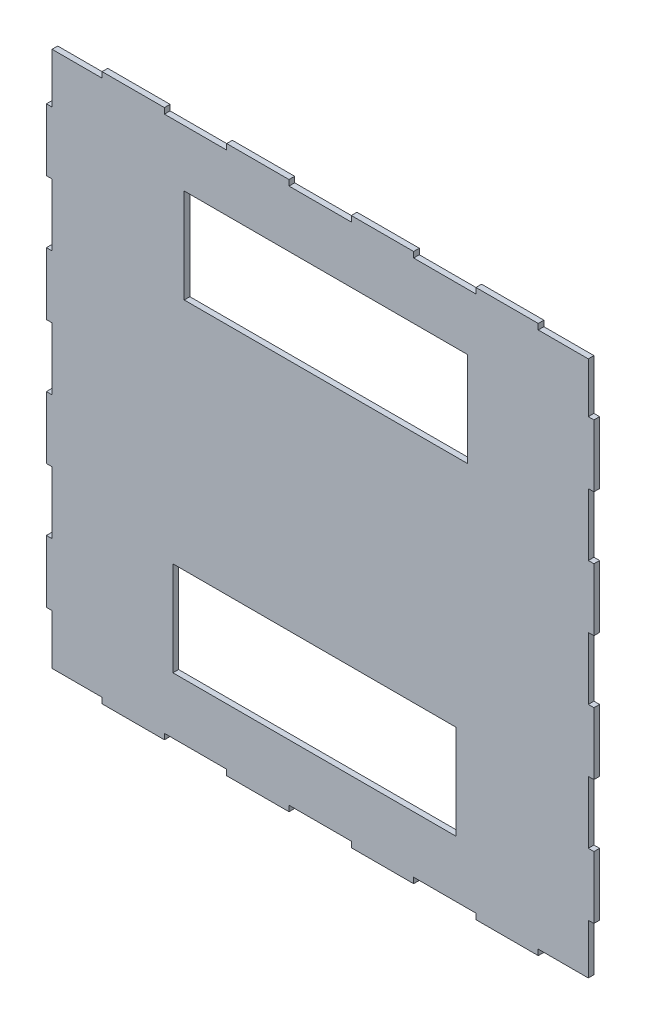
from build123d import *

# Parameters (mm, degrees)
SKETCH1_W           = 150
SKETCH1_H           = 50
BOSS_EXTRUDE1_DEPTH = 3


with BuildPart() as part:
    # Sketch1 → Boss-Extrude1 (new body)
    with BuildSketch(Plane.XY):
        Polygon((0, 0), (0, 26.5), (3, 26.5), (3, 59.5), (0, 59.5), (0, 92.5), (3, 92.5), (3, 125.5), (0, 125.5), (0, 158.5), (3, 158.5), (3, 191.5), (0, 191.5), (0, 224.5), (3, 224.5), (3, 257.5), (0, 257.5), (0, 284), (-26.5, 284), (-26.5, 287), (-59.5, 287), (-59.5, 284), (-92.5, 284), (-92.5, 287), (-125.5, 287), (-125.5, 284), (-158.5, 284), (-158.5, 287), (-191.5, 287), (-191.5, 284), (-224.5, 284), (-224.5, 287), (-257.5, 287), (-257.5, 284), (-284, 284), (-284, 257.5), (-287, 257.5), (-287, 224.5), (-284, 224.5), (-284, 191.5), (-287, 191.5), (-287, 158.5), (-284, 158.5), (-284, 125.5), (-287, 125.5), (-287, 92.5), (-284, 92.5), (-284, 59.5), (-287, 59.5), (-287, 26.5), (-284, 26.5), (-284, 0), (-257.5, 0), (-257.5, -3), (-224.5, -3), (-224.5, 0), (-191.5, 0), (-191.5, -3), (-158.5, -3), (-158.5, 0), (-125.5, 0), (-125.5, -3), (-92.5, -3), (-92.5, 0), (-59.5, 0), (-59.5, -3), (-26.5, -3), (-26.5, 0), align=None)
        with Locations((-139, 229)):
            Rectangle(SKETCH1_W, SKETCH1_H, mode=Mode.SUBTRACT)
        with Locations((-145, 55)):
            Rectangle(SKETCH1_W, SKETCH1_H, mode=Mode.SUBTRACT)
    extrude(amount=BOSS_EXTRUDE1_DEPTH)


solid = part.part
